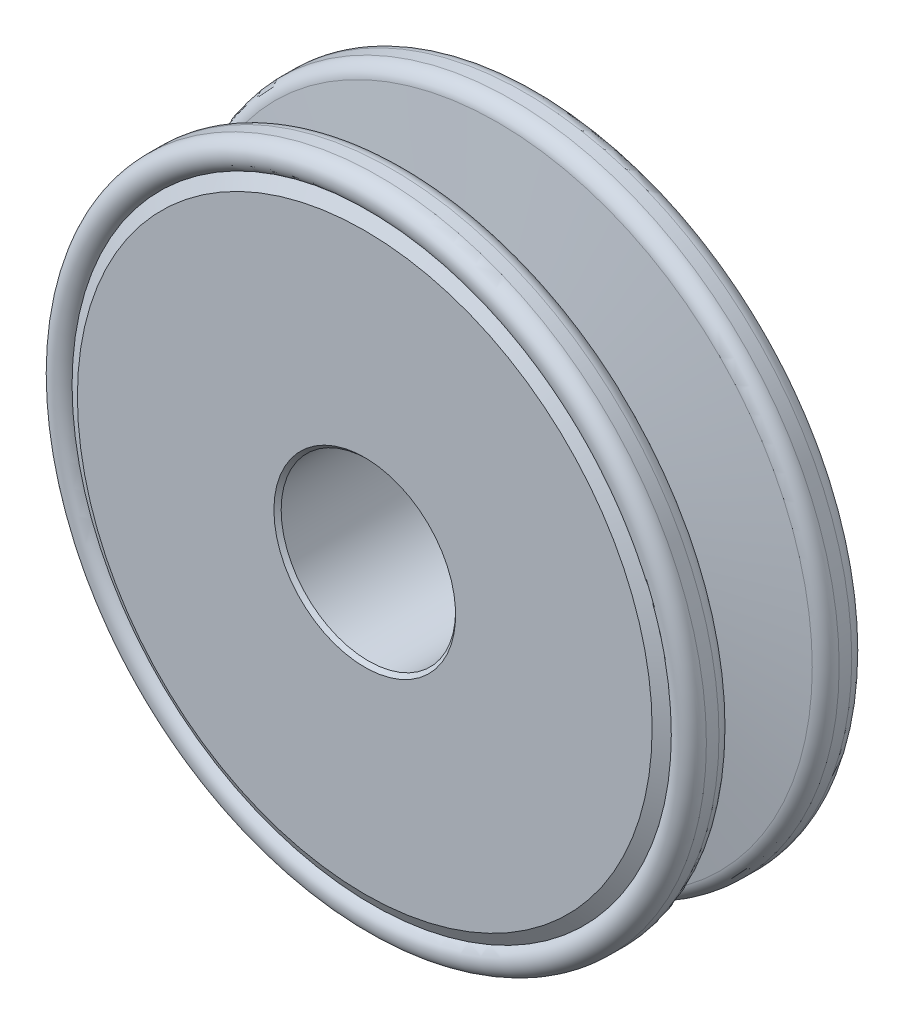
from build123d import *

# Parameters (mm, degrees)
CHAMFER_1_SIZE = 0.25


with BuildPart() as part:
    # Sketch 1 → Revolve 1 (revolve)
    with BuildSketch(Plane(origin=(0, 0, 0), x_dir=(0, 0, -1), z_dir=(1, 0, 0)), mode=Mode.PRIVATE) as revolve_1_sk:
        with BuildLine():
            Line((-6, 6), (6, 6))
            Line((6, 6), (6, 19.767949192))
            Line((6, 19.767949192), (5.5, 20.633974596))
            ThreePointArc((5.5, 20.633974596), (5.866025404, 21), (6, 21.5))
            ThreePointArc((6, 21.5), (5.707106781, 22.207106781), (5, 22.5))
            Line((5, 22.5), (4.13415425, 22.5))
            ThreePointArc((4.13415425, 22.5), (3.478095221, 22.25470958), (3.143886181, 21.639173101))
            Line((3.143886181, 21.639173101), (2, 13.5))
            Line((2, 13.5), (-2, 13.5))
            Line((-2, 13.5), (-3.143886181, 21.639173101))
            ThreePointArc((-3.143886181, 21.639173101), (-3.478095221, 22.25470958), (-4.13415425, 22.5))
            Line((-4.13415425, 22.5), (-5, 22.5))
            ThreePointArc((-5, 22.5), (-5.707106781, 22.207106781), (-6, 21.5))
            ThreePointArc((-6, 21.5), (-5.866025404, 21), (-5.5, 20.633974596))
            Line((-5.5, 20.633974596), (-6, 19.767949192))
            Line((-6, 19.767949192), (-6, 6))
        make_face()
    revolve(revolve_1_sk.sketch.rotate(Axis((0, 0, 6), (0, 0, -1)), 90), axis=Axis((0, 0, 6), (0, 0, -1)))

    # Chamfer 1
    chamfer_1_edges = [part.edges().sort_by_distance(p)[0] for p in [
        (-6, 0, -6),
        (-6, 0, 6),
    ]]
    chamfer(chamfer_1_edges, length=CHAMFER_1_SIZE)


solid = part.part
